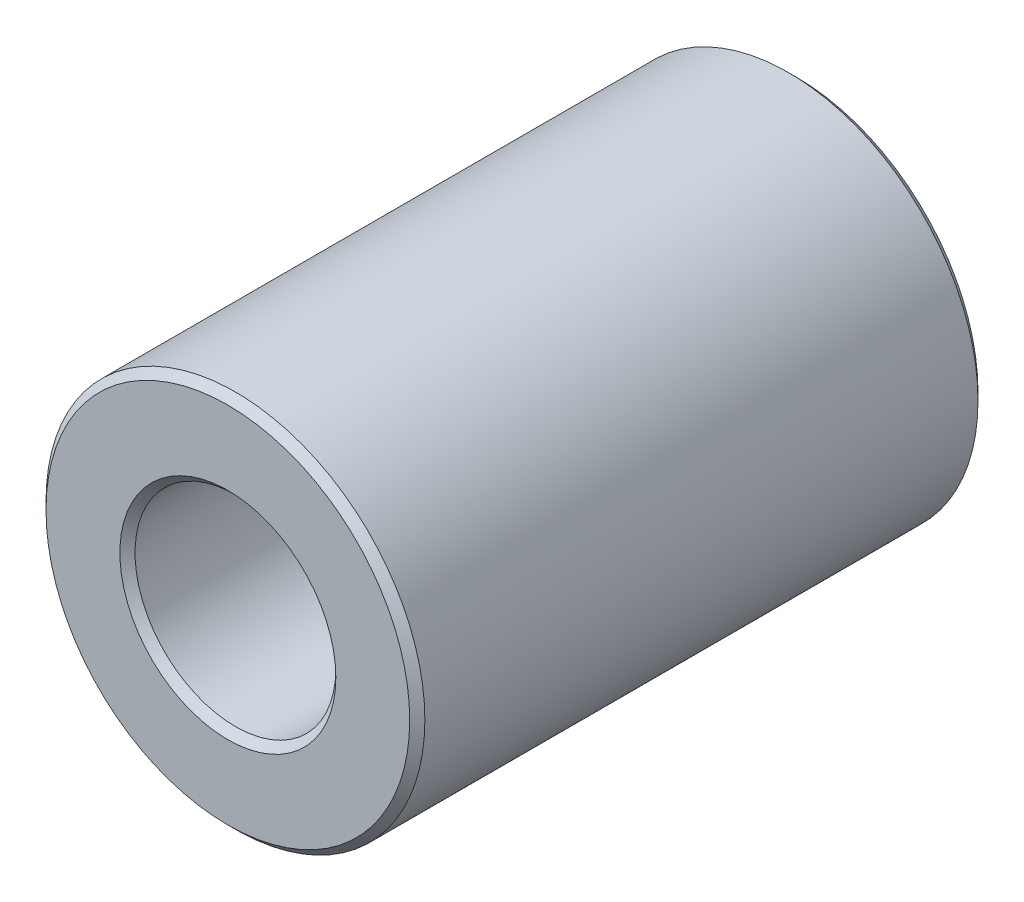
from build123d import *

# Parameters (mm, degrees)
SKETCH1_R           = 5
SKETCH1_R_2         = 2.65
BOSS_EXTRUDE2_DEPTH = 7.5
CHAMFER3_SIZE       = 0.2


with BuildPart() as part:
    # Sketch1 → Boss-Extrude2 (new, symmetric)
    with BuildSketch(Plane.XY):
        Circle(SKETCH1_R)
        Circle(SKETCH1_R_2, mode=Mode.SUBTRACT)
    extrude(amount=BOSS_EXTRUDE2_DEPTH, both=True)

    # Chamfer3
    chamfer3_edges = [part.edges().sort_by_distance(p)[0] for p in [
        (-5, 0, -7.5),
        (-5, 0, 7.5),
        (-2.65, 0, -7.5),
        (-2.65, 0, 7.5),
    ]]
    chamfer(chamfer3_edges, length=CHAMFER3_SIZE)


solid = part.part
